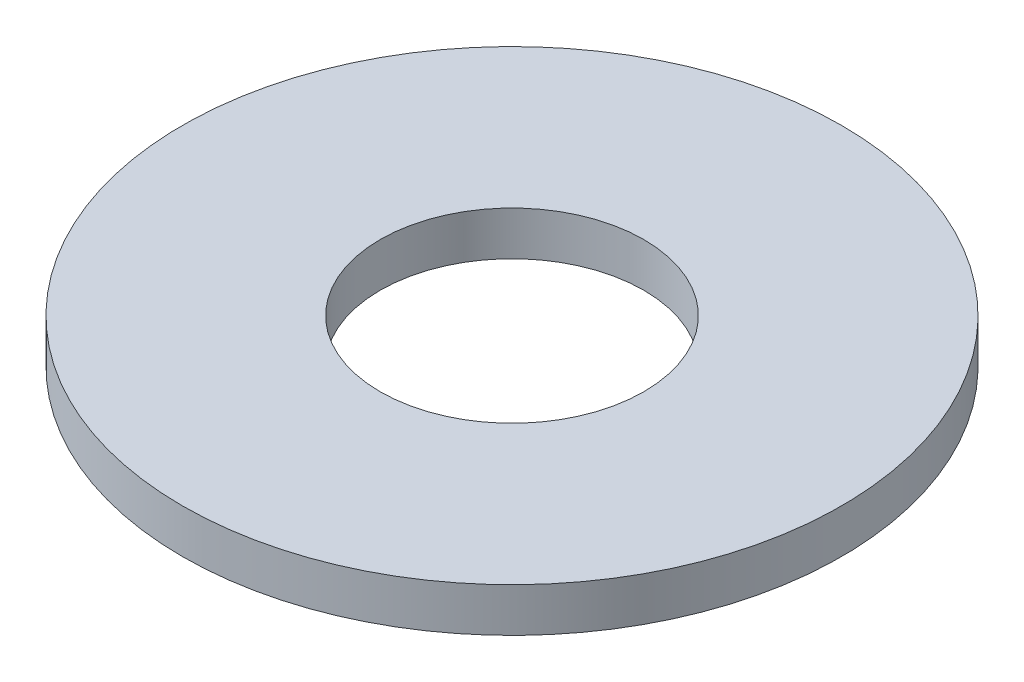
from build123d import *


with BuildPart() as part:
    # Esquisse1 → Base-R_volution (revolve)
    with BuildSketch(Plane.XY, mode=Mode.PRIVATE) as base_r_volution_sk:
        with BuildLine():
            Line((-6, 0), (-9.5, 0))
            ThreePointArc((-9.5, 0), (-11, 0.5), (-12.5, 0))
            Line((-12.5, 0), (-15, 0))
            Line((-15, 0), (-15, 2))
            Line((-15, 2), (-6, 2))
            Line((-6, 2), (-6, 0))
        make_face()
    revolve(base_r_volution_sk.sketch.rotate(Axis((0, 0, 0), (0, 1, 0)), 270), axis=Axis((0, 0, 0), (0, 1, 0)))


solid = part.part
